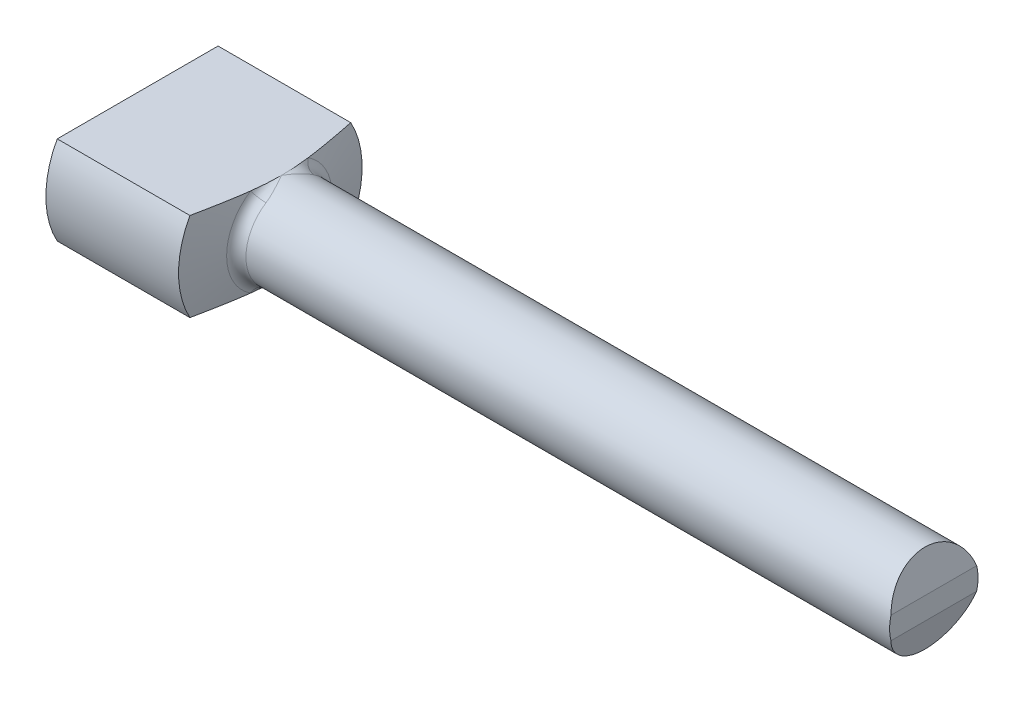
ISO-10303-21;
HEADER;
FILE_DESCRIPTION(('STEP AP214'),'2;1');
FILE_NAME('part.step','',(''),(''),'','','');
FILE_SCHEMA(('AUTOMOTIVE_DESIGN { 1 0 10303 214 1 1 1 1 }'));
ENDSEC;
DATA;
#1=APPLICATION_CONTEXT('core data for automotive mechanical design processes');
#2=APPLICATION_PROTOCOL_DEFINITION('international standard','automotive_design',2000,#1);
#3=PRODUCT_CONTEXT('',#1,'mechanical');
#4=PRODUCT('Part','Part','',(#3));
#5=PRODUCT_RELATED_PRODUCT_CATEGORY('part','',(#4));
#6=PRODUCT_DEFINITION_FORMATION('','',#4);
#7=PRODUCT_DEFINITION_CONTEXT('part definition',#1,'design');
#8=PRODUCT_DEFINITION('design','',#6,#7);
#9=PRODUCT_DEFINITION_SHAPE('','',#8);
#10=(LENGTH_UNIT() NAMED_UNIT(*) SI_UNIT(.MILLI.,.METRE.));
#11=(NAMED_UNIT(*) PLANE_ANGLE_UNIT() SI_UNIT($,.RADIAN.));
#12=(NAMED_UNIT(*) SI_UNIT($,.STERADIAN.) SOLID_ANGLE_UNIT());
#13=UNCERTAINTY_MEASURE_WITH_UNIT(LENGTH_MEASURE(1.E-05),#10,'distance_accuracy_value','');
#14=(GEOMETRIC_REPRESENTATION_CONTEXT(3) GLOBAL_UNCERTAINTY_ASSIGNED_CONTEXT((#13)) GLOBAL_UNIT_ASSIGNED_CONTEXT((#10,
#11,#12)) REPRESENTATION_CONTEXT('',''));
#15=CARTESIAN_POINT('',(0.,0.,0.));
#16=DIRECTION('',(0.,0.,1.));
#17=DIRECTION('',(1.,0.,0.));
#18=AXIS2_PLACEMENT_3D('',#15,#16,#17);
#19=CARTESIAN_POINT('',(0.,0.,0.));
#20=DIRECTION('',(-1.,0.,0.));
#21=DIRECTION('',(0.,-1.,0.));
#22=AXIS2_PLACEMENT_3D('',#19,#20,#21);
#23=PLANE('',#22);
#24=CARTESIAN_POINT('',(0.,0.,0.));
#25=DIRECTION('',(1.,0.,0.));
#26=DIRECTION('',(0.,1.,0.));
#27=AXIS2_PLACEMENT_3D('',#24,#25,#26);
#28=CIRCLE('',#27,4.15);
#29=CARTESIAN_POINT('',(0.,-2.,-3.63627556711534));
#30=VERTEX_POINT('',#29);
#31=CARTESIAN_POINT('',(0.,2.,-3.63627556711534));
#32=VERTEX_POINT('',#31);
#33=EDGE_CURVE('E137',#30,#32,#28,.T.);
#34=ORIENTED_EDGE('',*,*,#33,.F.);
#35=DIRECTION('',(0.,0.,1.));
#36=VECTOR('',#35,1.);
#37=CARTESIAN_POINT('',(0.,-2.,-4.5));
#38=LINE('',#37,#36);
#39=CARTESIAN_POINT('',(0.,-2.,3.63627556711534));
#40=VERTEX_POINT('',#39);
#41=EDGE_CURVE('E269',#30,#40,#38,.T.);
#42=ORIENTED_EDGE('',*,*,#41,.T.);
#43=CARTESIAN_POINT('',(0.,2.,3.63627556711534));
#44=VERTEX_POINT('',#43);
#45=EDGE_CURVE('E138',#44,#40,#28,.T.);
#46=ORIENTED_EDGE('',*,*,#45,.F.);
#47=DIRECTION('',(0.,0.,-1.));
#48=VECTOR('',#47,1.);
#49=CARTESIAN_POINT('',(0.,2.,-4.5));
#50=LINE('',#49,#48);
#51=EDGE_CURVE('E270',#44,#32,#50,.T.);
#52=ORIENTED_EDGE('',*,*,#51,.T.);
#53=EDGE_LOOP('',(#34,#42,#46,#52));
#54=FACE_BOUND('',#53,.T.);
#55=ADVANCED_FACE('F35',(#54),#23,.T.);
#56=CARTESIAN_POINT('',(36.,0.,0.));
#57=DIRECTION('',(1.,0.,0.));
#58=DIRECTION('',(0.,1.,0.));
#59=AXIS2_PLACEMENT_3D('',#56,#57,#58);
#60=CYLINDRICAL_SURFACE('',#59,4.15);
#61=CARTESIAN_POINT('',(6.,0.,0.));
#62=DIRECTION('',(1.,0.,0.));
#63=DIRECTION('',(0.,1.,0.));
#64=AXIS2_PLACEMENT_3D('',#61,#62,#63);
#65=CIRCLE('',#64,4.15);
#66=CARTESIAN_POINT('',(6.,-2.,-3.63627556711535));
#67=VERTEX_POINT('',#66);
#68=CARTESIAN_POINT('',(6.,2.,-3.63627556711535));
#69=VERTEX_POINT('',#68);
#70=EDGE_CURVE('E127',#67,#69,#65,.T.);
#71=ORIENTED_EDGE('',*,*,#70,.F.);
#72=DIRECTION('',(1.,0.,0.));
#73=VECTOR('',#72,1.);
#74=CARTESIAN_POINT('',(36.,-2.00000000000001,-3.63627556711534));
#75=LINE('',#74,#73);
#76=EDGE_CURVE('E276',#67,#30,#75,.F.);
#77=ORIENTED_EDGE('',*,*,#76,.T.);
#78=ORIENTED_EDGE('',*,*,#33,.T.);
#79=DIRECTION('',(1.,0.,0.));
#80=VECTOR('',#79,1.);
#81=CARTESIAN_POINT('',(36.,1.99999999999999,-3.63627556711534));
#82=LINE('',#81,#80);
#83=EDGE_CURVE('E274',#32,#69,#82,.T.);
#84=ORIENTED_EDGE('',*,*,#83,.T.);
#85=EDGE_LOOP('',(#71,#77,#78,#84));
#86=FACE_BOUND('',#85,.T.);
#87=ADVANCED_FACE('F257',(#86),#60,.T.);
#88=ORIENTED_EDGE('',*,*,#45,.T.);
#89=DIRECTION('',(1.,0.,0.));
#90=VECTOR('',#89,1.);
#91=CARTESIAN_POINT('',(36.,-2.00000000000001,3.63627556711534));
#92=LINE('',#91,#90);
#93=CARTESIAN_POINT('',(6.,-2.,3.63627556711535));
#94=VERTEX_POINT('',#93);
#95=EDGE_CURVE('E132',#40,#94,#92,.T.);
#96=ORIENTED_EDGE('',*,*,#95,.T.);
#97=CARTESIAN_POINT('',(6.,2.,3.63627556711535));
#98=VERTEX_POINT('',#97);
#99=EDGE_CURVE('E130',#98,#94,#65,.T.);
#100=ORIENTED_EDGE('',*,*,#99,.F.);
#101=DIRECTION('',(1.,0.,0.));
#102=VECTOR('',#101,1.);
#103=CARTESIAN_POINT('',(36.,1.99999999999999,3.63627556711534));
#104=LINE('',#103,#102);
#105=EDGE_CURVE('E335',#98,#44,#104,.F.);
#106=ORIENTED_EDGE('',*,*,#105,.T.);
#107=EDGE_LOOP('',(#88,#96,#100,#106));
#108=FACE_BOUND('',#107,.T.);
#109=ADVANCED_FACE('F262',(#108),#60,.T.);
#110=CARTESIAN_POINT('',(6.5,0.,0.));
#111=DIRECTION('',(-1.,0.,0.));
#112=DIRECTION('',(0.,-1.,0.));
#113=AXIS2_PLACEMENT_3D('',#110,#111,#112);
#114=CONICAL_SURFACE('',#113,2.,1.34229968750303);
#115=CARTESIAN_POINT('',(5.12737557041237,-2.,-7.64500549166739));
#116=CARTESIAN_POINT('',(5.20334260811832,-2.,-7.30717021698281));
#117=CARTESIAN_POINT('',(5.2790758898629,-2.,-6.96928079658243));
#118=CARTESIAN_POINT('',(5.42958193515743,-2.,-6.29342155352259));
#119=CARTESIAN_POINT('',(5.50435504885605,-2.,-5.95545180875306));
#120=CARTESIAN_POINT('',(5.65261306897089,-2.,-5.27871524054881));
#121=CARTESIAN_POINT('',(5.72609594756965,-2.,-4.9399479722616));
#122=CARTESIAN_POINT('',(5.87075559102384,-2.,-4.26178517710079));
#123=CARTESIAN_POINT('',(5.94193149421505,-2.,-3.92238946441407));
#124=CARTESIAN_POINT('',(6.0455945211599,-2.,-3.41180635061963));
#125=CARTESIAN_POINT('',(6.07971038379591,-2.,-3.24095078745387));
#126=CARTESIAN_POINT('',(6.14635827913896,-2.,-2.89893422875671));
#127=CARTESIAN_POINT('',(6.17889035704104,-2.,-2.72777324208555));
#128=CARTESIAN_POINT('',(6.24165463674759,-2.,-2.38511287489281));
#129=CARTESIAN_POINT('',(6.2718879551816,-2.,-2.21361370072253));
#130=CARTESIAN_POINT('',(6.3289672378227,-2.,-1.87005436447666));
#131=CARTESIAN_POINT('',(6.35581342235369,-2.,-1.69799423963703));
#132=CARTESIAN_POINT('',(6.40452988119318,-2.,-1.35260733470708));
#133=CARTESIAN_POINT('',(6.42638438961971,-2.,-1.17927827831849));
#134=CARTESIAN_POINT('',(6.46265633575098,-2.,-0.831852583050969));
#135=CARTESIAN_POINT('',(6.47707618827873,-2.,-0.657756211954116));
#136=CARTESIAN_POINT('',(6.49137298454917,-2.,-0.396212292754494));
#137=CARTESIAN_POINT('',(6.49491641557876,-2.,-0.308961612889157));
#138=CARTESIAN_POINT('',(6.49938692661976,-2.,-0.134394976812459));
#139=CARTESIAN_POINT('',(6.50031412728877,-2.,-0.0470790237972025));
#140=CARTESIAN_POINT('',(6.49949769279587,-2.,0.127540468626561));
#141=CARTESIAN_POINT('',(6.49775404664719,-2.,0.214844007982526));
#142=CARTESIAN_POINT('',(6.49169378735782,-2.,0.38935243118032));
#143=CARTESIAN_POINT('',(6.48737737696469,-2.,0.476557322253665));
#144=CARTESIAN_POINT('',(6.47214768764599,-2.,0.717917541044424));
#145=CARTESIAN_POINT('',(6.4587140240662,-2.,0.871915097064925));
#146=CARTESIAN_POINT('',(6.42610486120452,-2.,1.17931172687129));
#147=CARTESIAN_POINT('',(6.40692790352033,-2.,1.33271063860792));
#148=CARTESIAN_POINT('',(6.36443911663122,-2.,1.63907385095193));
#149=CARTESIAN_POINT('',(6.3411233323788,-2.,1.79203759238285));
#150=CARTESIAN_POINT('',(6.29160318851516,-2.,2.09747654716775));
#151=CARTESIAN_POINT('',(6.26539907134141,-2.,2.24995180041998));
#152=CARTESIAN_POINT('',(6.21087916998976,-2.,2.5549986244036));
#153=CARTESIAN_POINT('',(6.18255722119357,-2.,2.70756908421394));
#154=CARTESIAN_POINT('',(6.12445253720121,-2.,3.01243251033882));
#155=CARTESIAN_POINT('',(6.09466977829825,-2.,3.16472547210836));
#156=CARTESIAN_POINT('',(6.00378781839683,-2.,3.62112667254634));
#157=CARTESIAN_POINT('',(5.94112439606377,-2.,3.92492238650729));
#158=CARTESIAN_POINT('',(5.81275395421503,-2.,4.53546802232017));
#159=CARTESIAN_POINT('',(5.7470204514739,-2.,4.84221231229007));
#160=CARTESIAN_POINT('',(5.61408854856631,-2.,5.45542427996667));
#161=CARTESIAN_POINT('',(5.54688996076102,-2.,5.76189191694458));
#162=CARTESIAN_POINT('',(5.4116643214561,-2.,6.37412140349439));
#163=CARTESIAN_POINT('',(5.34363879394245,-2.,6.67988359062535));
#164=CARTESIAN_POINT('',(5.20694712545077,-2.,7.29126492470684));
#165=CARTESIAN_POINT('',(5.13828098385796,-2.,7.5968840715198));
#166=CARTESIAN_POINT('',(4.92715843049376,-2.,8.53336489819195));
#167=CARTESIAN_POINT('',(4.78397730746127,-2.,9.16406306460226));
#168=CARTESIAN_POINT('',(4.49652608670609,-2.,10.425563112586));
#169=CARTESIAN_POINT('',(4.35225545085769,-2.,11.0563648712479));
#170=CARTESIAN_POINT('',(4.06534027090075,-2.,12.3080451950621));
#171=CARTESIAN_POINT('',(3.92270520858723,-2.,12.9289259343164));
#172=CARTESIAN_POINT('',(3.63710597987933,-2.,14.1702648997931));
#173=CARTESIAN_POINT('',(3.49414202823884,-2.,14.7907231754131));
#174=CARTESIAN_POINT('',(3.35107184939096,-2.,15.4111567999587));
#175=B_SPLINE_CURVE_WITH_KNOTS('',3,(#115,#116,#117,#118,#119,#120,#121,#122,#123,#124,#125,
#126,#127,#128,#129,#130,#131,#132,#133,#134,#135,#136,#137,#138,#139,#140,#141,#142,#143,#144,
#145,#146,#147,#148,#149,#150,#151,#152,#153,#154,#155,#156,#157,#158,#159,#160,#161,#162,#163,
#164,#165,#166,#167,#168,#169,#170,#171,#172,#173,#174),.UNSPECIFIED.,.F.,.F.,(4,2,2,2,2,2,2,2,
2,2,2,2,2,2,2,2,2,2,2,2,2,2,2,2,2,2,2,2,2,4),(0.,1.03881568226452,2.07724111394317,
3.11717412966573,4.15749119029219,4.68017126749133,5.20283642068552,5.72524604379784,
6.24762166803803,6.77162504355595,7.29545811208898,7.55739149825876,7.81931280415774,
8.08123518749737,8.34313693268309,8.80672568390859,9.27043225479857,9.73458435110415,
10.1986975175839,10.6642185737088,11.1297471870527,12.060300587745,13.001422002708,
13.9426646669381,14.8823775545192,15.8220913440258,17.7623288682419,19.7035971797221,
21.6147586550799,23.5249061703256),.UNSPECIFIED.);
#176=CARTESIAN_POINT('',(6.41005970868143,-2.,1.30251424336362));
#177=VERTEX_POINT('',#176);
#178=EDGE_CURVE('E282',#94,#177,#175,.F.);
#179=ORIENTED_EDGE('',*,*,#178,.T.);
#180=CARTESIAN_POINT('',(6.41005970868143,0.,0.));
#181=DIRECTION('',(-1.,0.,0.));
#182=DIRECTION('',(0.,-1.,0.));
#183=AXIS2_PLACEMENT_3D('',#180,#181,#182);
#184=CIRCLE('',#183,2.38674325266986);
#185=CARTESIAN_POINT('',(6.41005970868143,2.,1.30251424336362));
#186=VERTEX_POINT('',#185);
#187=EDGE_CURVE('E217',#177,#186,#184,.T.);
#188=ORIENTED_EDGE('',*,*,#187,.T.);
#189=CARTESIAN_POINT('',(5.12737557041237,2.,-7.64500549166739));
#190=CARTESIAN_POINT('',(5.20334260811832,2.,-7.30717021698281));
#191=CARTESIAN_POINT('',(5.2790758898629,2.,-6.96928079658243));
#192=CARTESIAN_POINT('',(5.42958193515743,2.,-6.29342155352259));
#193=CARTESIAN_POINT('',(5.50435504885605,2.,-5.95545180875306));
#194=CARTESIAN_POINT('',(5.65261306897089,2.,-5.27871524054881));
#195=CARTESIAN_POINT('',(5.72609594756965,2.,-4.9399479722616));
#196=CARTESIAN_POINT('',(5.87075559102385,2.,-4.26178517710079));
#197=CARTESIAN_POINT('',(5.94193149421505,2.,-3.92238946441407));
#198=CARTESIAN_POINT('',(6.0455945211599,2.,-3.41180635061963));
#199=CARTESIAN_POINT('',(6.07971038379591,2.,-3.24095078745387));
#200=CARTESIAN_POINT('',(6.14635827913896,2.,-2.89893422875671));
#201=CARTESIAN_POINT('',(6.17889035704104,2.,-2.72777324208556));
#202=CARTESIAN_POINT('',(6.24165463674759,2.,-2.38511287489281));
#203=CARTESIAN_POINT('',(6.27188795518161,2.,-2.21361370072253));
#204=CARTESIAN_POINT('',(6.3289672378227,2.,-1.87005436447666));
#205=CARTESIAN_POINT('',(6.35581342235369,2.,-1.69799423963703));
#206=CARTESIAN_POINT('',(6.40452988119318,2.,-1.35260733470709));
#207=CARTESIAN_POINT('',(6.42638438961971,2.,-1.1792782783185));
#208=CARTESIAN_POINT('',(6.46265633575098,2.,-0.831852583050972));
#209=CARTESIAN_POINT('',(6.47707618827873,2.,-0.657756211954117));
#210=CARTESIAN_POINT('',(6.49137298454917,2.,-0.396212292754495));
#211=CARTESIAN_POINT('',(6.49491641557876,2.,-0.308961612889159));
#212=CARTESIAN_POINT('',(6.49938692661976,2.,-0.134394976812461));
#213=CARTESIAN_POINT('',(6.50031412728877,2.,-0.0470790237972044));
#214=CARTESIAN_POINT('',(6.49949769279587,2.,0.127540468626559));
#215=CARTESIAN_POINT('',(6.49775404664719,2.,0.214844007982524));
#216=CARTESIAN_POINT('',(6.49169378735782,2.,0.389352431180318));
#217=CARTESIAN_POINT('',(6.4873773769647,2.,0.476557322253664));
#218=CARTESIAN_POINT('',(6.47214768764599,2.,0.717917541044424));
#219=CARTESIAN_POINT('',(6.4587140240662,2.,0.871915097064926));
#220=CARTESIAN_POINT('',(6.42610486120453,2.,1.17931172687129));
#221=CARTESIAN_POINT('',(6.40692790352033,2.,1.33271063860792));
#222=CARTESIAN_POINT('',(6.36443911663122,2.,1.63907385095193));
#223=CARTESIAN_POINT('',(6.3411233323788,2.,1.79203759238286));
#224=CARTESIAN_POINT('',(6.29160318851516,2.,2.09747654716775));
#225=CARTESIAN_POINT('',(6.26539907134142,2.,2.24995180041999));
#226=CARTESIAN_POINT('',(6.21087916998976,2.,2.55499862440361));
#227=CARTESIAN_POINT('',(6.18255722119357,2.,2.70756908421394));
#228=CARTESIAN_POINT('',(6.12445253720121,2.,3.01243251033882));
#229=CARTESIAN_POINT('',(6.09466977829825,2.,3.16472547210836));
#230=CARTESIAN_POINT('',(6.00378781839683,2.,3.62112667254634));
#231=CARTESIAN_POINT('',(5.94112439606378,2.,3.9249223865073));
#232=CARTESIAN_POINT('',(5.81275395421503,2.,4.53546802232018));
#233=CARTESIAN_POINT('',(5.7470204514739,2.,4.84221231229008));
#234=CARTESIAN_POINT('',(5.61408854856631,2.,5.45542427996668));
#235=CARTESIAN_POINT('',(5.54688996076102,2.,5.76189191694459));
#236=CARTESIAN_POINT('',(5.4116643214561,2.,6.3741214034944));
#237=CARTESIAN_POINT('',(5.34363879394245,2.,6.67988359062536));
#238=CARTESIAN_POINT('',(5.20694712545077,2.,7.29126492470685));
#239=CARTESIAN_POINT('',(5.13828098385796,2.,7.59688407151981));
#240=CARTESIAN_POINT('',(4.92715843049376,2.,8.53336489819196));
#241=CARTESIAN_POINT('',(4.78397730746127,2.,9.16406306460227));
#242=CARTESIAN_POINT('',(4.49652608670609,2.,10.425563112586));
#243=CARTESIAN_POINT('',(4.35225545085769,2.,11.0563648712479));
#244=CARTESIAN_POINT('',(4.06534027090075,2.,12.3080451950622));
#245=CARTESIAN_POINT('',(3.92270520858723,2.,12.9289259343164));
#246=CARTESIAN_POINT('',(3.63710597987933,2.,14.1702648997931));
#247=CARTESIAN_POINT('',(3.49414202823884,2.,14.7907231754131));
#248=CARTESIAN_POINT('',(3.35107184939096,2.,15.4111567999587));
#249=B_SPLINE_CURVE_WITH_KNOTS('',3,(#189,#190,#191,#192,#193,#194,#195,#196,#197,#198,#199,
#200,#201,#202,#203,#204,#205,#206,#207,#208,#209,#210,#211,#212,#213,#214,#215,#216,#217,#218,
#219,#220,#221,#222,#223,#224,#225,#226,#227,#228,#229,#230,#231,#232,#233,#234,#235,#236,#237,
#238,#239,#240,#241,#242,#243,#244,#245,#246,#247,#248),.UNSPECIFIED.,.F.,.F.,(4,2,2,2,2,2,2,2,
2,2,2,2,2,2,2,2,2,2,2,2,2,2,2,2,2,2,2,2,2,4),(0.,1.03881568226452,2.07724111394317,
3.11717412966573,4.15749119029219,4.68017126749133,5.20283642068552,5.72524604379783,
6.24762166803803,6.77162504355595,7.29545811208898,7.55739149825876,7.81931280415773,
8.08123518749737,8.34313693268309,8.80672568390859,9.27043225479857,9.73458435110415,
10.1986975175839,10.6642185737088,11.1297471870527,12.0603005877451,13.001422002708,
13.9426646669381,14.8823775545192,15.8220913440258,17.7623288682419,19.7035971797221,
21.6147586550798,23.5249061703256),.UNSPECIFIED.);
#250=EDGE_CURVE('E329',#186,#98,#249,.T.);
#251=ORIENTED_EDGE('',*,*,#250,.T.);
#252=ORIENTED_EDGE('',*,*,#99,.T.);
#253=EDGE_LOOP('',(#179,#188,#251,#252));
#254=FACE_BOUND('',#253,.T.);
#255=ADVANCED_FACE('F160',(#254),#114,.T.);
#256=CARTESIAN_POINT('',(6.41005970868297,2.,-1.30251424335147));
#257=VERTEX_POINT('',#256);
#258=EDGE_CURVE('E336',#69,#257,#249,.T.);
#259=ORIENTED_EDGE('',*,*,#258,.T.);
#260=CARTESIAN_POINT('',(6.41005970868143,0.,0.));
#261=DIRECTION('',(-1.,0.,0.));
#262=DIRECTION('',(0.,-1.,0.));
#263=AXIS2_PLACEMENT_3D('',#260,#261,#262);
#264=CIRCLE('',#263,2.38674325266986);
#265=CARTESIAN_POINT('',(6.41005970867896,-2.,-1.3025142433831));
#266=VERTEX_POINT('',#265);
#267=EDGE_CURVE('E215',#257,#266,#264,.T.);
#268=ORIENTED_EDGE('',*,*,#267,.T.);
#269=EDGE_CURVE('E284',#266,#67,#175,.F.);
#270=ORIENTED_EDGE('',*,*,#269,.T.);
#271=ORIENTED_EDGE('',*,*,#70,.T.);
#272=EDGE_LOOP('',(#259,#268,#270,#271));
#273=FACE_BOUND('',#272,.T.);
#274=ADVANCED_FACE('F158',(#273),#114,.T.);
#275=CARTESIAN_POINT('',(36.,0.,0.));
#276=DIRECTION('',(1.,0.,0.));
#277=DIRECTION('',(0.,1.,0.));
#278=AXIS2_PLACEMENT_3D('',#275,#276,#277);
#279=CYLINDRICAL_SURFACE('',#278,2.);
#280=CARTESIAN_POINT('',(36.1333333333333,0.,0.));
#281=DIRECTION('',(-0.966234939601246,0.257662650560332,0.));
#282=DIRECTION('',(0.257662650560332,0.966234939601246,0.));
#283=AXIS2_PLACEMENT_3D('',#280,#281,#282);
#284=ELLIPSE('',#283,2.06988995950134,2.);
#285=CARTESIAN_POINT('',(36.,-0.5,1.93649167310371));
#286=VERTEX_POINT('',#285);
#287=CARTESIAN_POINT('',(36.,-0.500000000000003,-1.93649167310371));
#288=VERTEX_POINT('',#287);
#289=EDGE_CURVE('E48',#286,#288,#284,.F.);
#290=ORIENTED_EDGE('',*,*,#289,.F.);
#291=CARTESIAN_POINT('',(36.,0.,0.));
#292=DIRECTION('',(1.,0.,0.));
#293=DIRECTION('',(0.,1.,0.));
#294=AXIS2_PLACEMENT_3D('',#291,#292,#293);
#295=CIRCLE('',#294,2.);
#296=CARTESIAN_POINT('',(36.,0.500000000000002,1.93649167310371));
#297=VERTEX_POINT('',#296);
#298=EDGE_CURVE('E123',#297,#286,#295,.T.);
#299=ORIENTED_EDGE('',*,*,#298,.F.);
#300=CARTESIAN_POINT('',(36.1333333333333,0.,0.));
#301=DIRECTION('',(-0.966234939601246,-0.257662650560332,0.));
#302=DIRECTION('',(0.257662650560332,-0.966234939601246,0.));
#303=AXIS2_PLACEMENT_3D('',#300,#301,#302);
#304=ELLIPSE('',#303,2.06988995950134,2.);
#305=CARTESIAN_POINT('',(36.,0.5,-1.9364916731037));
#306=VERTEX_POINT('',#305);
#307=EDGE_CURVE('E55',#306,#297,#304,.F.);
#308=ORIENTED_EDGE('',*,*,#307,.F.);
#309=EDGE_CURVE('E124',#288,#306,#295,.T.);
#310=ORIENTED_EDGE('',*,*,#309,.F.);
#311=EDGE_LOOP('',(#290,#299,#308,#310));
#312=FACE_BOUND('',#311,.T.);
#313=CARTESIAN_POINT('',(6.50000000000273,-2.,1.15042992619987E-08));
#314=CARTESIAN_POINT('',(6.50000000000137,-2.,5.75214963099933E-09));
#315=CARTESIAN_POINT('',(6.5,-2.,0.));
#316=CARTESIAN_POINT('',(6.50000072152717,-2.,0.00304313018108));
#317=CARTESIAN_POINT('',(6.50068078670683,-2.00000013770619,0.00273865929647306));
#318=CARTESIAN_POINT('',(6.50136078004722,-1.99999998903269,0.00243421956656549));
#319=CARTESIAN_POINT('',(6.49999977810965,-2.,0.00608547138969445));
#320=CARTESIAN_POINT('',(6.50136006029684,-1.99999457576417,0.00547725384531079));
#321=CARTESIAN_POINT('',(6.50272026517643,-1.99999554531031,0.00486902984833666));
#322=CARTESIAN_POINT('',(6.49987879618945,-2.,0.147485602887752));
#323=CARTESIAN_POINT('',(6.53287536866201,-1.99947175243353,0.132824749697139));
#324=CARTESIAN_POINT('',(6.56586017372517,-1.99958253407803,0.118088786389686));
#325=CARTESIAN_POINT('',(6.49632760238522,-2.,0.284223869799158));
#326=CARTESIAN_POINT('',(6.56086544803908,-1.98710911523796,0.258903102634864));
#327=CARTESIAN_POINT('',(6.62489550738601,-1.98999023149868,0.230072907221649));
#328=CARTESIAN_POINT('',(6.4834819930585,-2.,0.553574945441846));
#329=CARTESIAN_POINT('',(6.5994675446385,-1.94063206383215,0.501556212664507));
#330=CARTESIAN_POINT('',(6.73145405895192,-1.95099107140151,0.454519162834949));
#331=CARTESIAN_POINT('',(6.47418067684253,-2.,0.686182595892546));
#332=CARTESIAN_POINT('',(6.6100908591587,-1.90519982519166,0.6212500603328));
#333=CARTESIAN_POINT('',(6.77896334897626,-1.92156040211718,0.566981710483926));
#334=CARTESIAN_POINT('',(6.45643362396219,-2.,0.888207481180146));
#335=CARTESIAN_POINT('',(6.60419272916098,-1.83934094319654,0.790113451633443));
#336=CARTESIAN_POINT('',(6.83721387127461,-1.85952475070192,0.739212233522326));
#337=CARTESIAN_POINT('',(6.44945626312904,-2.,0.959431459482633));
#338=CARTESIAN_POINT('',(6.59719812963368,-1.81275141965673,0.848644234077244));
#339=CARTESIAN_POINT('',(6.85490346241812,-1.83418888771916,0.800112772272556));
#340=CARTESIAN_POINT('',(6.43452141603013,-2.,1.09971179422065));
#341=CARTESIAN_POINT('',(6.57174895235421,-1.75760618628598,0.957198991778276));
#342=CARTESIAN_POINT('',(6.8819376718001,-1.77715693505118,0.919823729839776));
#343=CARTESIAN_POINT('',(6.42656892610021,-2.,1.16877709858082));
#344=CARTESIAN_POINT('',(6.55271609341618,-1.72870948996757,1.00740050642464));
#345=CARTESIAN_POINT('',(6.89132295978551,-1.74549278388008,0.978642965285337));
#346=CARTESIAN_POINT('',(6.41167286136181,-2.,1.2905778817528));
#347=CARTESIAN_POINT('',(6.50655593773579,-1.67980265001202,1.08625582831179));
#348=CARTESIAN_POINT('',(6.89820760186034,-1.68318544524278,1.0815397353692));
#349=CARTESIAN_POINT('',(6.40485320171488,-2.,1.34377686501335));
#350=CARTESIAN_POINT('',(6.48108207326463,-1.65892457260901,1.11739211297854));
#351=CARTESIAN_POINT('',(6.89773671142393,-1.65364523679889,1.12618178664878));
#352=CARTESIAN_POINT('',(6.39443044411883,-2.,1.4220863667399));
#353=CARTESIAN_POINT('',(6.43676328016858,-1.63278964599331,1.15589057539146));
#354=CARTESIAN_POINT('',(6.89026069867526,-1.60683859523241,1.19113063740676));
#355=CARTESIAN_POINT('',(6.39090763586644,-2.,1.44805515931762));
#356=CARTESIAN_POINT('',(6.42048035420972,-1.62479809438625,1.16755773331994));
#357=CARTESIAN_POINT('',(6.88660837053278,-1.59074193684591,1.21253653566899));
#358=CARTESIAN_POINT('',(6.38383238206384,-2.,1.49934297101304));
#359=CARTESIAN_POINT('',(6.38585897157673,-1.61132499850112,1.18782845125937));
#360=CARTESIAN_POINT('',(6.87670456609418,-1.55787843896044,1.25448388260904));
#361=CARTESIAN_POINT('',(6.38027989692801,-2.,1.52466083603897));
#362=CARTESIAN_POINT('',(6.36744013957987,-1.60591588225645,1.19634537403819));
#363=CARTESIAN_POINT('',(6.8704487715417,-1.54111052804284,1.27502383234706));
#364=CARTESIAN_POINT('',(6.37673112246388,-2.,1.54957798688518));
#365=CARTESIAN_POINT('',(6.34846637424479,-1.60233422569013,1.20296441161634));
#366=CARTESIAN_POINT('',(6.86274216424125,-1.52409864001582,1.29503796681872));
#367=(BOUNDED_SURFACE() B_SPLINE_SURFACE(3,2,((#313,#314,#315),(#316,#317,#318),(#319,#320,
#321),(#322,#323,#324),(#325,#326,#327),(#328,#329,#330),(#331,#332,#333),(#334,#335,#336),
(#337,#338,#339),(#340,#341,#342),(#343,#344,#345),(#346,#347,#348),(#349,#350,#351),(#352,#353,
#354),(#355,#356,#357),(#358,#359,#360),(#361,#362,#363),(#364,#365,#366)),.UNSPECIFIED.,.F.,
.F.,.F.) B_SPLINE_SURFACE_WITH_KNOTS((4,2,2,2,2,2,2,2,4),(3,3),(0.,0.0100000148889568,
0.464894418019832,0.920335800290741,1.17266356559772,1.42374862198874,1.62374926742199,
1.72466475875,1.82574830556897),(0.,1.),
.UNSPECIFIED.) GEOMETRIC_REPRESENTATION_ITEM() RATIONAL_B_SPLINE_SURFACE(((1.,1.,1.),(1.,
0.999999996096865,1.),(1.,0.999996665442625,1.),(1.,0.999687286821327,1.),(1.,0.992505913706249,
1.),(1.,0.964855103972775,1.),(1.,0.944369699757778,1.),(1.,0.902565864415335,1.),(1.,
0.885693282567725,1.),(1.,0.848235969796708,1.),(1.,0.827669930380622,1.),(1.,0.787689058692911,
1.),(1.,0.768891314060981,1.),(1.,0.739324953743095,1.),(1.,0.729192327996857,1.),(1.,
0.708553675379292,1.),(1.,0.698047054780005,1.),(1.,0.687401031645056,1.))) REPRESENTATION_ITEM('') SURFACE());
#368=CARTESIAN_POINT('',(6.86274216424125,-1.52409864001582,1.29503796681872));
#369=CARTESIAN_POINT('',(6.8704487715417,-1.54111052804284,1.27502383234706));
#370=CARTESIAN_POINT('',(6.87670456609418,-1.55787843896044,1.25448388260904));
#371=CARTESIAN_POINT('',(6.88660837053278,-1.59074193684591,1.21253653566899));
#372=CARTESIAN_POINT('',(6.89026069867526,-1.60683859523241,1.19113063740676));
#373=CARTESIAN_POINT('',(6.89773671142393,-1.65364523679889,1.12618178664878));
#374=CARTESIAN_POINT('',(6.89820760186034,-1.68318544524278,1.0815397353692));
#375=CARTESIAN_POINT('',(6.89132295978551,-1.74549278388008,0.978642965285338));
#376=CARTESIAN_POINT('',(6.8819376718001,-1.77715693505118,0.919823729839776));
#377=CARTESIAN_POINT('',(6.85490346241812,-1.83418888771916,0.800112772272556));
#378=CARTESIAN_POINT('',(6.83721387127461,-1.85952475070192,0.739212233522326));
#379=CARTESIAN_POINT('',(6.77896334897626,-1.92156040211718,0.566981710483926));
#380=CARTESIAN_POINT('',(6.73145405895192,-1.95099107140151,0.45451916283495));
#381=CARTESIAN_POINT('',(6.62489550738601,-1.98999023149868,0.230072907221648));
#382=CARTESIAN_POINT('',(6.56586017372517,-1.99958253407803,0.118088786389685));
#383=CARTESIAN_POINT('',(6.50272026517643,-1.99999554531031,0.00486902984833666));
#384=CARTESIAN_POINT('',(6.50136078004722,-1.99999998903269,0.00243421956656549));
#385=CARTESIAN_POINT('',(6.5,-2.,0.));
#386=B_SPLINE_CURVE_WITH_KNOTS('',3,(#368,#369,#370,#371,#372,#373,#374,#375,#376,#377,#378,
#379,#380,#381,#382,#383,#384,#385),.UNSPECIFIED.,.F.,.F.,(4,2,2,2,2,2,2,2,4),(0.,
0.101083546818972,0.201999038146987,0.40199968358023,0.653084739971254,0.905412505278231,
1.36085388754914,1.81574829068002,1.82574830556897),.UNSPECIFIED.);
#387=CARTESIAN_POINT('',(6.89706372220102,-1.67592387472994,1.09145735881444));
#388=VERTEX_POINT('',#387);
#389=CARTESIAN_POINT('',(6.5,-2.,0.));
#390=VERTEX_POINT('',#389);
#391=EDGE_CURVE('E141',#388,#390,#386,.T.);
#392=ORIENTED_EDGE('',*,*,#391,.T.);
#393=CARTESIAN_POINT('',(6.36942423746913,-2.,-1.60036790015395));
#394=CARTESIAN_POINT('',(6.30776919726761,-1.59757637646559,-1.21421361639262));
#395=CARTESIAN_POINT('',(6.84470146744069,-1.48873836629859,-1.33553662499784));
#396=CARTESIAN_POINT('',(6.37604066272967,-2.,-1.55483239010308));
#397=CARTESIAN_POINT('',(6.3448456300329,-1.59911398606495,-1.20691951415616));
#398=CARTESIAN_POINT('',(6.86297956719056,-1.52113555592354,-1.29950830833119));
#399=CARTESIAN_POINT('',(6.38270453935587,-2.,-1.50777814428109));
#400=CARTESIAN_POINT('',(6.38041730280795,-1.60815009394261,-1.19244616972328));
#401=CARTESIAN_POINT('',(6.8758477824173,-1.55281402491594,-1.26147754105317));
#402=CARTESIAN_POINT('',(6.39586784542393,-2.,-1.41175442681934));
#403=CARTESIAN_POINT('',(6.44332078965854,-1.63500539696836,-1.15241687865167));
#404=CARTESIAN_POINT('',(6.89258022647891,-1.61355594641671,-1.18272018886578));
#405=CARTESIAN_POINT('',(6.40236822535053,-2.,-1.36280666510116));
#406=CARTESIAN_POINT('',(6.47120736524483,-1.65234290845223,-1.12746155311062));
#407=CARTESIAN_POINT('',(6.89652654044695,-1.64264085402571,-1.14202175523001));
#408=CARTESIAN_POINT('',(6.4178996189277,-2.,-1.24111867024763));
#409=CARTESIAN_POINT('',(6.52785240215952,-1.69857454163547,-1.05690773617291));
#410=CARTESIAN_POINT('',(6.89771451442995,-1.70987887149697,-1.03997731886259));
#411=CARTESIAN_POINT('',(6.42677069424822,-2.,-1.16747657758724));
#412=CARTESIAN_POINT('',(6.5535077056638,-1.72967347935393,-1.00663105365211));
#413=CARTESIAN_POINT('',(6.89119480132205,-1.74631382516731,-0.977496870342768));
#414=CARTESIAN_POINT('',(6.44349318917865,-2.,-1.01750741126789));
#415=CARTESIAN_POINT('',(6.58893384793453,-1.79021231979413,-0.895169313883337));
#416=CARTESIAN_POINT('',(6.86768715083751,-1.81194311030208,-0.849743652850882));
#417=CARTESIAN_POINT('',(6.45133838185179,-2.,-0.941167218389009));
#418=CARTESIAN_POINT('',(6.59956646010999,-1.82003452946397,-0.833877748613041));
#419=CARTESIAN_POINT('',(6.85063858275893,-1.84109412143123,-0.784456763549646));
#420=CARTESIAN_POINT('',(6.46859692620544,-2.,-0.754010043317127));
#421=CARTESIAN_POINT('',(6.61058332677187,-1.88445037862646,-0.679003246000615));
#422=CARTESIAN_POINT('',(6.80010917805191,-1.90257765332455,-0.624729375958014));
#423=CARTESIAN_POINT('',(6.47727629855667,-2.,-0.642230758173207));
#424=CARTESIAN_POINT('',(6.60601431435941,-1.91761530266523,-0.579994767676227));
#425=CARTESIAN_POINT('',(6.76273055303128,-1.93106721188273,-0.529605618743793));
#426=CARTESIAN_POINT('',(6.49074077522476,-2.,-0.415668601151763));
#427=CARTESIAN_POINT('',(6.58183573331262,-1.96705931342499,-0.377635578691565));
#428=CARTESIAN_POINT('',(6.67825299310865,-1.97343809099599,-0.339208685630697));
#429=CARTESIAN_POINT('',(6.49553138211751,-2.,-0.300890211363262));
#430=CARTESIAN_POINT('',(6.56246534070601,-1.98433710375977,-0.272491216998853));
#431=CARTESIAN_POINT('',(6.63116791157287,-1.98734006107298,-0.243935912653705));
#432=CARTESIAN_POINT('',(6.49927419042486,-2.,-0.126542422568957));
#433=CARTESIAN_POINT('',(6.52772396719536,-1.99746979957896,-0.11428300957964));
#434=CARTESIAN_POINT('',(6.55613961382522,-1.9979758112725,-0.101762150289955));
#435=CARTESIAN_POINT('',(6.49994676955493,-2.,-0.0679969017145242));
#436=CARTESIAN_POINT('',(6.51515708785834,-1.99976829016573,-0.0612255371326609));
#437=CARTESIAN_POINT('',(6.53036566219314,-1.99981453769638,-0.0544413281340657));
#438=CARTESIAN_POINT('',(6.49999977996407,-2.,-0.00608554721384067));
#439=CARTESIAN_POINT('',(6.50136004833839,-1.99999444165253,-0.00547735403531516));
#440=CARTESIAN_POINT('',(6.50272030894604,-1.99999555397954,-0.00486912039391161));
#441=CARTESIAN_POINT('',(6.50000072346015,-2.,-0.00304320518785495));
#442=CARTESIAN_POINT('',(6.50068077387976,-1.99999999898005,-0.00273876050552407));
#443=CARTESIAN_POINT('',(6.50136082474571,-1.99999999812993,-0.0024343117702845));
#444=CARTESIAN_POINT('',(6.5,-2.,0.));
#445=CARTESIAN_POINT('',(6.5,-2.,0.));
#446=CARTESIAN_POINT('',(6.5,-2.,0.));
#447=(BOUNDED_SURFACE() B_SPLINE_SURFACE(3,2,((#393,#394,#395),(#396,#397,#398),(#399,#400,
#401),(#402,#403,#404),(#405,#406,#407),(#408,#409,#410),(#411,#412,#413),(#414,#415,#416),
(#417,#418,#419),(#420,#421,#422),(#423,#424,#425),(#426,#427,#428),(#429,#430,#431),(#432,#433,
#434),(#435,#436,#437),(#438,#439,#440),(#441,#442,#443),(#444,#445,#446)),.UNSPECIFIED.,.F.,
.F.,.F.) B_SPLINE_SURFACE_WITH_KNOTS((4,2,2,2,2,2,2,2,4),(3,3),(0.,0.188984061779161,
0.376222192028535,0.646714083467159,0.918778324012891,1.30558037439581,1.69183414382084,
1.88539135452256,1.89539136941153),(0.,1.),
.UNSPECIFIED.) GEOMETRIC_REPRESENTATION_ITEM() RATIONAL_B_SPLINE_SURFACE(((1.,0.665271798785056,
1.),(1.,0.685516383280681,1.),(1.,0.705350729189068,1.),(1.,0.743546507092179,1.),(1.,
0.761919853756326,1.),(1.,0.804716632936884,1.),(1.,0.828197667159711,1.),(1.,0.870990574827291,
1.),(1.,0.890277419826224,1.),(1.,0.931465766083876,1.),(1.,0.951039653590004,1.),(1.,
0.980651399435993,1.),(1.,0.990702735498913,1.),(1.,0.998485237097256,1.),(1.,0.99986111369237,
1.),(1.,0.999996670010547,1.),(1.,1.00000000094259,1.),(1.,1.,1.))) REPRESENTATION_ITEM('') SURFACE());
#448=CARTESIAN_POINT('',(6.84470146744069,-1.48873836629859,-1.33553662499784));
#449=CARTESIAN_POINT('',(6.86297956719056,-1.52113555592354,-1.29950830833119));
#450=CARTESIAN_POINT('',(6.8758477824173,-1.55281402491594,-1.26147754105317));
#451=CARTESIAN_POINT('',(6.89258022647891,-1.61355594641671,-1.18272018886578));
#452=CARTESIAN_POINT('',(6.89652654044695,-1.64264085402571,-1.14202175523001));
#453=CARTESIAN_POINT('',(6.89771451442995,-1.70987887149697,-1.03997731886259));
#454=CARTESIAN_POINT('',(6.89119480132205,-1.74631382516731,-0.977496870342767));
#455=CARTESIAN_POINT('',(6.86768715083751,-1.81194311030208,-0.849743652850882));
#456=CARTESIAN_POINT('',(6.85063858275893,-1.84109412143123,-0.784456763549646));
#457=CARTESIAN_POINT('',(6.80010917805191,-1.90257765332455,-0.624729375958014));
#458=CARTESIAN_POINT('',(6.76273055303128,-1.93106721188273,-0.529605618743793));
#459=CARTESIAN_POINT('',(6.67825299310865,-1.97343809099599,-0.339208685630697));
#460=CARTESIAN_POINT('',(6.63116791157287,-1.98734006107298,-0.243935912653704));
#461=CARTESIAN_POINT('',(6.55613961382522,-1.9979758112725,-0.101762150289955));
#462=CARTESIAN_POINT('',(6.53036566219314,-1.99981453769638,-0.054441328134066));
#463=CARTESIAN_POINT('',(6.50272030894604,-1.99999555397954,-0.00486912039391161));
#464=CARTESIAN_POINT('',(6.50136082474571,-1.99999999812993,-0.0024343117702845));
#465=CARTESIAN_POINT('',(6.5,-2.,0.));
#466=B_SPLINE_CURVE_WITH_KNOTS('',3,(#448,#449,#450,#451,#452,#453,#454,#455,#456,#457,#458,
#459,#460,#461,#462,#463,#464,#465),.UNSPECIFIED.,.F.,.F.,(4,2,2,2,2,2,2,2,4),(0.,
0.188984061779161,0.376222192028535,0.646714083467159,0.918778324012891,1.30558037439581,
1.69183414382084,1.88539135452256,1.89539136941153),.UNSPECIFIED.);
#467=CARTESIAN_POINT('',(6.89706372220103,-1.67592387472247,-1.0914573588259));
#468=VERTEX_POINT('',#467);
#469=EDGE_CURVE('E209',#390,#468,#466,.F.);
#470=ORIENTED_EDGE('',*,*,#469,.T.);
#471=CARTESIAN_POINT('',(6.89706372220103,0.,0.));
#472=DIRECTION('',(1.,0.,0.));
#473=DIRECTION('',(0.,1.,0.));
#474=AXIS2_PLACEMENT_3D('',#471,#472,#473);
#475=CIRCLE('',#474,2.);
#476=CARTESIAN_POINT('',(6.89706372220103,1.67592387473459,-1.09145735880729));
#477=VERTEX_POINT('',#476);
#478=EDGE_CURVE('E205',#468,#477,#475,.T.);
#479=ORIENTED_EDGE('',*,*,#478,.T.);
#480=CARTESIAN_POINT('',(6.5,2.,0.));
#481=CARTESIAN_POINT('',(6.5,2.,0.));
#482=CARTESIAN_POINT('',(6.5,2.,0.));
#483=CARTESIAN_POINT('',(6.50000072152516,2.,-0.00304312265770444));
#484=CARTESIAN_POINT('',(6.50068078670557,2.00000013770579,-0.00273865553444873));
#485=CARTESIAN_POINT('',(6.50136078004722,1.99999998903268,-0.00243421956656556));
#486=CARTESIAN_POINT('',(6.49999977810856,2.,-0.00608546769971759));
#487=CARTESIAN_POINT('',(6.50136006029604,1.99999457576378,-0.00547725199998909));
#488=CARTESIAN_POINT('',(6.50272026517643,1.99999554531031,-0.00486902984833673));
#489=CARTESIAN_POINT('',(6.49987879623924,2.,-0.147485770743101));
#490=CARTESIAN_POINT('',(6.53287536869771,1.99947175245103,-0.132824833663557));
#491=CARTESIAN_POINT('',(6.56586017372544,1.99958253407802,-0.11808878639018));
#492=CARTESIAN_POINT('',(6.49632760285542,2.,-0.284223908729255));
#493=CARTESIAN_POINT('',(6.56086544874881,1.98710911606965,-0.258903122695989));
#494=CARTESIAN_POINT('',(6.62489550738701,1.98999023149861,-0.230072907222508));
#495=CARTESIAN_POINT('',(6.48348199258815,2.,-0.553574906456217));
#496=CARTESIAN_POINT('',(6.59946754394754,1.94063206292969,-0.501556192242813));
#497=CARTESIAN_POINT('',(6.73145405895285,1.95099107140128,-0.454519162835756));
#498=CARTESIAN_POINT('',(6.47418067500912,2.,-0.686182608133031));
#499=CARTESIAN_POINT('',(6.6100908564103,1.9051998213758,-0.621250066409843));
#500=CARTESIAN_POINT('',(6.77896334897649,1.92156040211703,-0.566981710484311));
#501=CARTESIAN_POINT('',(6.45643362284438,2.,-0.888207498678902));
#502=CARTESIAN_POINT('',(6.60419272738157,1.83934094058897,-0.790113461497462));
#503=CARTESIAN_POINT('',(6.83721387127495,1.85952475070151,-0.739212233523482));
#504=CARTESIAN_POINT('',(6.44945626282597,2.,-0.959431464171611));
#505=CARTESIAN_POINT('',(6.59719812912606,1.81275141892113,-0.84864423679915));
#506=CARTESIAN_POINT('',(6.8549034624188,1.83418888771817,-0.800112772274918));
#507=CARTESIAN_POINT('',(6.43452141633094,2.,-1.09971178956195));
#508=CARTESIAN_POINT('',(6.57174895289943,1.75760618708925,-0.957198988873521));
#509=CARTESIAN_POINT('',(6.88193767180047,1.77715693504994,-0.919823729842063));
#510=CARTESIAN_POINT('',(6.42656892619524,2.,-1.16877709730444));
#511=CARTESIAN_POINT('',(6.55271609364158,1.72870949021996,-1.00740050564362));
#512=CARTESIAN_POINT('',(6.89132295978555,1.74549278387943,-0.978642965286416));
#513=CARTESIAN_POINT('',(6.41167286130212,2.,-1.29057788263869));
#514=CARTESIAN_POINT('',(6.50655593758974,1.67980264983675,-1.08625582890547));
#515=CARTESIAN_POINT('',(6.89820760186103,1.68318544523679,-1.08153973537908));
#516=CARTESIAN_POINT('',(6.40485320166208,2.,-1.34377686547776));
#517=CARTESIAN_POINT('',(6.4810820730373,1.65892457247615,-1.11739211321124));
#518=CARTESIAN_POINT('',(6.8977367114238,1.65364523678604,-1.12618178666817));
#519=CARTESIAN_POINT('',(6.39443044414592,2.,-1.42208636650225));
#520=CARTESIAN_POINT('',(6.43676328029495,1.63278964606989,-1.15589057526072));
#521=CARTESIAN_POINT('',(6.89026069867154,1.60683859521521,-1.19113063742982));
#522=CARTESIAN_POINT('',(6.39090763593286,2.,-1.44805515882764));
#523=CARTESIAN_POINT('',(6.42048035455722,1.62479809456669,-1.1675577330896));
#524=CARTESIAN_POINT('',(6.88660837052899,1.59074193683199,-1.21253653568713));
#525=CARTESIAN_POINT('',(6.38383238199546,2.,-1.49934297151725));
#526=CARTESIAN_POINT('',(6.38585897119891,1.61132499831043,-1.18782845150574));
#527=CARTESIAN_POINT('',(6.87670456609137,1.5578784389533,-1.25448388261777));
#528=CARTESIAN_POINT('',(6.38027989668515,2.,-1.5246608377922));
#529=CARTESIAN_POINT('',(6.36744013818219,1.6059158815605,-1.19634537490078));
#530=CARTESIAN_POINT('',(6.87044877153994,1.54111052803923,-1.27502383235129));
#531=CARTESIAN_POINT('',(6.37673112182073,2.,-1.54957799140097));
#532=CARTESIAN_POINT('',(6.34846637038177,1.60233422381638,-1.20296441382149));
#533=CARTESIAN_POINT('',(6.86274216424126,1.52409864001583,-1.29503796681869));
#534=(BOUNDED_SURFACE() B_SPLINE_SURFACE(3,2,((#480,#481,#482),(#483,#484,#485),(#486,#487,
#488),(#489,#490,#491),(#492,#493,#494),(#495,#496,#497),(#498,#499,#500),(#501,#502,#503),
(#504,#505,#506),(#507,#508,#509),(#510,#511,#512),(#513,#514,#515),(#516,#517,#518),(#519,#520,
#521),(#522,#523,#524),(#525,#526,#527),(#528,#529,#530),(#531,#532,#533)),.UNSPECIFIED.,.F.,
.F.,.F.) B_SPLINE_SURFACE_WITH_KNOTS((4,2,2,2,2,2,2,2,4),(3,3),(0.,0.0100000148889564,
0.464894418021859,0.920335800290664,1.17266356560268,1.42374862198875,1.62374926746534,
1.72466475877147,1.82574830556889),(0.,1.),
.UNSPECIFIED.) GEOMETRIC_REPRESENTATION_ITEM() RATIONAL_B_SPLINE_SURFACE(((1.,1.,1.),(1.,
0.999999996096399,1.),(1.,0.999996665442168,1.),(1.,0.999687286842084,1.),(1.,0.992505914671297,
1.),(1.,0.9648551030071,1.),(1.,0.944369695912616,1.),(1.,0.902565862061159,1.),(1.,
0.885693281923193,1.),(1.,0.848235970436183,1.),(1.,0.827669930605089,1.),(1.,0.787689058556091,
1.),(1.,0.768891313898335,1.),(1.,0.739324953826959,1.),(1.,0.729192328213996,1.),(1.,
0.708553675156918,1.),(1.,0.698047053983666,1.),(1.,0.687401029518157,1.))) REPRESENTATION_ITEM('') SURFACE());
#535=CARTESIAN_POINT('',(6.86274216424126,1.52409864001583,-1.29503796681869));
#536=CARTESIAN_POINT('',(6.87044877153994,1.54111052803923,-1.27502383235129));
#537=CARTESIAN_POINT('',(6.87670456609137,1.5578784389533,-1.25448388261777));
#538=CARTESIAN_POINT('',(6.88660837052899,1.59074193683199,-1.21253653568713));
#539=CARTESIAN_POINT('',(6.89026069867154,1.60683859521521,-1.19113063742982));
#540=CARTESIAN_POINT('',(6.8977367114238,1.65364523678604,-1.12618178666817));
#541=CARTESIAN_POINT('',(6.89820760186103,1.68318544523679,-1.08153973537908));
#542=CARTESIAN_POINT('',(6.89132295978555,1.74549278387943,-0.978642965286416));
#543=CARTESIAN_POINT('',(6.88193767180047,1.77715693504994,-0.919823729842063));
#544=CARTESIAN_POINT('',(6.8549034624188,1.83418888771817,-0.800112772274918));
#545=CARTESIAN_POINT('',(6.83721387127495,1.85952475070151,-0.739212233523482));
#546=CARTESIAN_POINT('',(6.7789633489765,1.92156040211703,-0.566981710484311));
#547=CARTESIAN_POINT('',(6.73145405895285,1.95099107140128,-0.454519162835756));
#548=CARTESIAN_POINT('',(6.62489550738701,1.98999023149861,-0.230072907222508));
#549=CARTESIAN_POINT('',(6.56586017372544,1.99958253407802,-0.11808878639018));
#550=CARTESIAN_POINT('',(6.50272026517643,1.99999554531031,-0.00486902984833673));
#551=CARTESIAN_POINT('',(6.50136078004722,1.99999998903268,-0.00243421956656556));
#552=CARTESIAN_POINT('',(6.5,2.,0.));
#553=B_SPLINE_CURVE_WITH_KNOTS('',3,(#535,#536,#537,#538,#539,#540,#541,#542,#543,#544,#545,
#546,#547,#548,#549,#550,#551,#552),.UNSPECIFIED.,.F.,.F.,(4,2,2,2,2,2,2,2,4),(0.,
0.101083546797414,0.201999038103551,0.401999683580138,0.653084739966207,0.905412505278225,
1.36085388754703,1.81574829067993,1.82574830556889),.UNSPECIFIED.);
#554=CARTESIAN_POINT('',(6.5,2.,0.));
#555=VERTEX_POINT('',#554);
#556=EDGE_CURVE('E199',#477,#555,#553,.T.);
#557=ORIENTED_EDGE('',*,*,#556,.T.);
#558=CARTESIAN_POINT('',(6.36942423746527,2.,1.60036790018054));
#559=CARTESIAN_POINT('',(6.30776919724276,1.59757637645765,1.2142136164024));
#560=CARTESIAN_POINT('',(6.84470146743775,1.48873836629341,1.33553662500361));
#561=CARTESIAN_POINT('',(6.37604066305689,2.,1.55483238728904));
#562=CARTESIAN_POINT('',(6.34484563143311,1.59911398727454,1.20691951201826));
#563=CARTESIAN_POINT('',(6.86297956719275,1.52113555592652,1.29950830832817));
#564=CARTESIAN_POINT('',(6.38270453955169,2.,1.50777814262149));
#565=CARTESIAN_POINT('',(6.38041730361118,1.60815009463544,1.19244616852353));
#566=CARTESIAN_POINT('',(6.87584778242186,1.55281402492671,1.2614775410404));
#567=CARTESIAN_POINT('',(6.39586784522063,2.,1.41175442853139));
#568=CARTESIAN_POINT('',(6.44332078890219,1.63500539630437,1.15241687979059));
#569=CARTESIAN_POINT('',(6.89258022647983,1.61355594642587,1.18272018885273));
#570=CARTESIAN_POINT('',(6.40236822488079,2.,1.36280666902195));
#571=CARTESIAN_POINT('',(6.47120736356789,1.65234290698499,1.12746155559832));
#572=CARTESIAN_POINT('',(6.89652654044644,1.64264085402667,1.14202175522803));
#573=CARTESIAN_POINT('',(6.41789961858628,2.,1.24111867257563));
#574=CARTESIAN_POINT('',(6.52785240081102,1.6985745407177,1.05690773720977));
#575=CARTESIAN_POINT('',(6.89771451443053,1.70987887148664,1.039977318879));
#576=CARTESIAN_POINT('',(6.42677069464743,2.,1.16747657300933));
#577=CARTESIAN_POINT('',(6.55350770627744,1.7296734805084,1.00663105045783));
#578=CARTESIAN_POINT('',(6.89119480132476,1.74631382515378,0.977496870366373));
#579=CARTESIAN_POINT('',(6.44349318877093,2.,1.01750741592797));
#580=CARTESIAN_POINT('',(6.58893384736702,1.7902123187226,0.895169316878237));
#581=CARTESIAN_POINT('',(6.86768715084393,1.81194311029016,0.849743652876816));
#582=CARTESIAN_POINT('',(6.45133837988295,2.,0.94116723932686));
#583=CARTESIAN_POINT('',(6.59956645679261,1.82003452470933,0.833877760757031));
#584=CARTESIAN_POINT('',(6.85063858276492,1.84109412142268,0.784456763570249));
#585=CARTESIAN_POINT('',(6.4685969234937,2.,0.754010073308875));
#586=CARTESIAN_POINT('',(6.61058332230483,1.88445037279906,0.679003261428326));
#587=CARTESIAN_POINT('',(6.80010917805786,1.9025776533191,0.624729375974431));
#588=CARTESIAN_POINT('',(6.47727629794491,2.,0.642230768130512));
#589=CARTESIAN_POINT('',(6.60601431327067,1.91761530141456,0.579994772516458));
#590=CARTESIAN_POINT('',(6.76273055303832,1.93106721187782,0.529605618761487));
#591=CARTESIAN_POINT('',(6.49074077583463,2.,0.415668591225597));
#592=CARTESIAN_POINT('',(6.58183573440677,1.96705931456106,0.377635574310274));
#593=CARTESIAN_POINT('',(6.67825299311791,1.97343809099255,0.339208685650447));
#594=CARTESIAN_POINT('',(6.49553138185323,2.,0.300890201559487));
#595=CARTESIAN_POINT('',(6.56246534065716,1.98433710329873,0.272491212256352));
#596=CARTESIAN_POINT('',(6.63116791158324,1.98734006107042,0.243935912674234));
#597=CARTESIAN_POINT('',(6.49927419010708,2.,0.126542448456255));
#598=CARTESIAN_POINT('',(6.52772396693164,1.99746979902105,0.11428302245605));
#599=CARTESIAN_POINT('',(6.55613961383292,1.99797581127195,0.101762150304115));
#600=CARTESIAN_POINT('',(6.49994676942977,2.,0.0679969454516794));
#601=CARTESIAN_POINT('',(6.51515708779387,1.99976828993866,0.0612255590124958));
#602=CARTESIAN_POINT('',(6.53036566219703,1.99981453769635,0.0544413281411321));
#603=CARTESIAN_POINT('',(6.49999977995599,2.,0.00608556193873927));
#604=CARTESIAN_POINT('',(6.50136004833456,1.99999444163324,0.00547736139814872));
#605=CARTESIAN_POINT('',(6.50272030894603,1.99999555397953,0.00486912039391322));
#606=CARTESIAN_POINT('',(6.50000072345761,2.,0.00304321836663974));
#607=CARTESIAN_POINT('',(6.50068077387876,1.99999999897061,0.00273876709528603));
#608=CARTESIAN_POINT('',(6.50136082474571,1.99999999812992,0.00243431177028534));
#609=CARTESIAN_POINT('',(6.50000000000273,2.,1.15042992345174E-08));
#610=CARTESIAN_POINT('',(6.50000000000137,2.,5.75214961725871E-09));
#611=CARTESIAN_POINT('',(6.5,2.,0.));
#612=(BOUNDED_SURFACE() B_SPLINE_SURFACE(3,2,((#558,#559,#560),(#561,#562,#563),(#564,#565,
#566),(#567,#568,#569),(#570,#571,#572),(#573,#574,#575),(#576,#577,#578),(#579,#580,#581),
(#582,#583,#584),(#585,#586,#587),(#588,#589,#590),(#591,#592,#593),(#594,#595,#596),(#597,#598,
#599),(#600,#601,#602),(#603,#604,#605),(#606,#607,#608),(#609,#610,#611)),.UNSPECIFIED.,.F.,
.F.,.F.) B_SPLINE_SURFACE_WITH_KNOTS((4,2,2,2,2,2,2,2,4),(3,3),(0.,0.188984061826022,
0.376222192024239,0.646714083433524,0.918778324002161,1.30558037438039,1.69183414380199,
1.88539135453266,1.89539136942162),(0.,1.),
.UNSPECIFIED.) GEOMETRIC_REPRESENTATION_ITEM() RATIONAL_B_SPLINE_SURFACE(((1.,0.665271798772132,
1.),(1.,0.685516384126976,1.),(1.,0.705350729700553,1.),(1.,0.743546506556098,1.),(1.,
0.761919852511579,1.),(1.,0.804716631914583,1.),(1.,0.828197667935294,1.),(1.,0.870990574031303,
1.),(1.,0.890277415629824,1.),(1.,0.931465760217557,1.),(1.,0.951039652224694,1.),(1.,
0.980651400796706,1.),(1.,0.990702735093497,1.),(1.,0.998485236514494,1.),(1.,0.999861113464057,
1.),(1.,0.999996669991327,1.),(1.,1.00000000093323,1.),(1.,1.,1.))) REPRESENTATION_ITEM('') SURFACE());
#613=CARTESIAN_POINT('',(6.84470146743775,1.48873836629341,1.33553662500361));
#614=CARTESIAN_POINT('',(6.86297956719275,1.52113555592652,1.29950830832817));
#615=CARTESIAN_POINT('',(6.87584778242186,1.55281402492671,1.2614775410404));
#616=CARTESIAN_POINT('',(6.89258022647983,1.61355594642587,1.18272018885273));
#617=CARTESIAN_POINT('',(6.89652654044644,1.64264085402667,1.14202175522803));
#618=CARTESIAN_POINT('',(6.89771451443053,1.70987887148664,1.039977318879));
#619=CARTESIAN_POINT('',(6.89119480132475,1.74631382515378,0.977496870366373));
#620=CARTESIAN_POINT('',(6.86768715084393,1.81194311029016,0.849743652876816));
#621=CARTESIAN_POINT('',(6.85063858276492,1.84109412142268,0.784456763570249));
#622=CARTESIAN_POINT('',(6.80010917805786,1.9025776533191,0.624729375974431));
#623=CARTESIAN_POINT('',(6.76273055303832,1.93106721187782,0.529605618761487));
#624=CARTESIAN_POINT('',(6.67825299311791,1.97343809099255,0.339208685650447));
#625=CARTESIAN_POINT('',(6.63116791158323,1.98734006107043,0.243935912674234));
#626=CARTESIAN_POINT('',(6.55613961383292,1.99797581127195,0.101762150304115));
#627=CARTESIAN_POINT('',(6.53036566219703,1.99981453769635,0.0544413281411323));
#628=CARTESIAN_POINT('',(6.50272030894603,1.99999555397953,0.00486912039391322));
#629=CARTESIAN_POINT('',(6.50136082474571,1.99999999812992,0.00243431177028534));
#630=CARTESIAN_POINT('',(6.5,2.,0.));
#631=B_SPLINE_CURVE_WITH_KNOTS('',3,(#613,#614,#615,#616,#617,#618,#619,#620,#621,#622,#623,
#624,#625,#626,#627,#628,#629,#630),.UNSPECIFIED.,.F.,.F.,(4,2,2,2,2,2,2,2,4),(0.,
0.188984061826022,0.376222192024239,0.646714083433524,0.918778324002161,1.30558037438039,
1.69183414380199,1.88539135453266,1.89539136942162),.UNSPECIFIED.);
#632=CARTESIAN_POINT('',(6.89706372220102,1.67592387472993,1.09145735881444));
#633=VERTEX_POINT('',#632);
#634=EDGE_CURVE('E194',#555,#633,#631,.F.);
#635=ORIENTED_EDGE('',*,*,#634,.T.);
#636=CARTESIAN_POINT('',(6.89706372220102,0.,0.));
#637=DIRECTION('',(1.,0.,0.));
#638=DIRECTION('',(0.,1.,0.));
#639=AXIS2_PLACEMENT_3D('',#636,#637,#638);
#640=CIRCLE('',#639,2.);
#641=EDGE_CURVE('E148',#633,#388,#640,.T.);
#642=ORIENTED_EDGE('',*,*,#641,.T.);
#643=EDGE_LOOP('',(#392,#470,#479,#557,#635,#642));
#644=FACE_BOUND('',#643,.T.);
#645=ADVANCED_FACE('F121',(#312,#644),#279,.T.);
#646=CARTESIAN_POINT('',(36.,1.99999999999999,0.));
#647=DIRECTION('',(1.,0.,0.));
#648=DIRECTION('',(0.,1.,0.));
#649=AXIS2_PLACEMENT_3D('',#646,#647,#648);
#650=PLANE('',#649);
#651=DIRECTION('',(0.,0.,1.));
#652=VECTOR('',#651,1.);
#653=CARTESIAN_POINT('',(36.,-0.500000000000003,0.));
#654=LINE('',#653,#652);
#655=EDGE_CURVE('E12',#288,#286,#654,.T.);
#656=ORIENTED_EDGE('',*,*,#655,.F.);
#657=ORIENTED_EDGE('',*,*,#309,.T.);
#658=DIRECTION('',(0.,0.,-1.));
#659=VECTOR('',#658,1.);
#660=CARTESIAN_POINT('',(36.,0.500000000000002,0.));
#661=LINE('',#660,#659);
#662=EDGE_CURVE('E43',#297,#306,#661,.T.);
#663=ORIENTED_EDGE('',*,*,#662,.F.);
#664=ORIENTED_EDGE('',*,*,#298,.T.);
#665=EDGE_LOOP('',(#656,#657,#663,#664));
#666=FACE_BOUND('',#665,.T.);
#667=ADVANCED_FACE('F126',(#666),#650,.T.);
#668=CARTESIAN_POINT('',(10.,2.,-4.5));
#669=DIRECTION('',(0.,1.,0.));
#670=DIRECTION('',(-1.,0.,0.));
#671=AXIS2_PLACEMENT_3D('',#668,#669,#670);
#672=PLANE('',#671);
#673=ORIENTED_EDGE('',*,*,#51,.F.);
#674=ORIENTED_EDGE('',*,*,#105,.F.);
#675=ORIENTED_EDGE('',*,*,#250,.F.);
#676=EDGE_CURVE('E330',#555,#186,#249,.T.);
#677=ORIENTED_EDGE('',*,*,#676,.F.);
#678=EDGE_CURVE('E338',#257,#555,#249,.T.);
#679=ORIENTED_EDGE('',*,*,#678,.F.);
#680=ORIENTED_EDGE('',*,*,#258,.F.);
#681=ORIENTED_EDGE('',*,*,#83,.F.);
#682=EDGE_LOOP('',(#673,#674,#675,#677,#679,#680,#681));
#683=FACE_BOUND('',#682,.T.);
#684=ADVANCED_FACE('F295',(#683),#672,.T.);
#685=CARTESIAN_POINT('',(10.,-2.,-4.5));
#686=DIRECTION('',(0.,-1.,0.));
#687=DIRECTION('',(1.,0.,0.));
#688=AXIS2_PLACEMENT_3D('',#685,#686,#687);
#689=PLANE('',#688);
#690=ORIENTED_EDGE('',*,*,#41,.F.);
#691=ORIENTED_EDGE('',*,*,#76,.F.);
#692=ORIENTED_EDGE('',*,*,#269,.F.);
#693=EDGE_CURVE('E280',#390,#266,#175,.F.);
#694=ORIENTED_EDGE('',*,*,#693,.F.);
#695=EDGE_CURVE('E279',#177,#390,#175,.F.);
#696=ORIENTED_EDGE('',*,*,#695,.F.);
#697=ORIENTED_EDGE('',*,*,#178,.F.);
#698=ORIENTED_EDGE('',*,*,#95,.F.);
#699=EDGE_LOOP('',(#690,#691,#692,#694,#696,#697,#698));
#700=FACE_BOUND('',#699,.T.);
#701=ADVANCED_FACE('F253',(#700),#689,.T.);
#702=ORIENTED_EDGE('',*,*,#678,.T.);
#703=ORIENTED_EDGE('',*,*,#556,.F.);
#704=CARTESIAN_POINT('',(6.89706372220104,2.09490484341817,-1.36432169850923));
#705=DIRECTION('',(-6.17539370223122E-12,0.545728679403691,0.837961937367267));
#706=DIRECTION('',(0.,-0.837961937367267,0.545728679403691));
#707=AXIS2_PLACEMENT_3D('',#704,#705,#706);
#708=CIRCLE('',#707,0.5);
#709=EDGE_CURVE('E221',#257,#477,#708,.T.);
#710=ORIENTED_EDGE('',*,*,#709,.F.);
#711=EDGE_LOOP('',(#702,#703,#710));
#712=FACE_BOUND('',#711,.T.);
#713=ADVANCED_FACE('F175',(#712),#534,.F.);
#714=CARTESIAN_POINT('',(6.89706372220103,0.,0.));
#715=DIRECTION('',(1.,0.,0.));
#716=DIRECTION('',(0.,1.,0.));
#717=AXIS2_PLACEMENT_3D('',#714,#715,#716);
#718=TOROIDAL_SURFACE('',#717,2.5,0.5);
#719=ORIENTED_EDGE('',*,*,#709,.T.);
#720=ORIENTED_EDGE('',*,*,#478,.F.);
#721=CARTESIAN_POINT('',(6.89706372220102,-2.09490484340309,-1.36432169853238));
#722=DIRECTION('',(0.,0.545728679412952,-0.837961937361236));
#723=DIRECTION('',(0.,0.837961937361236,0.545728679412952));
#724=AXIS2_PLACEMENT_3D('',#721,#722,#723);
#725=CIRCLE('',#724,0.5);
#726=EDGE_CURVE('E219',#266,#468,#725,.T.);
#727=ORIENTED_EDGE('',*,*,#726,.F.);
#728=ORIENTED_EDGE('',*,*,#267,.F.);
#729=EDGE_LOOP('',(#719,#720,#727,#728));
#730=FACE_BOUND('',#729,.T.);
#731=ADVANCED_FACE('F245',(#730),#718,.F.);
#732=ORIENTED_EDGE('',*,*,#469,.F.);
#733=ORIENTED_EDGE('',*,*,#693,.T.);
#734=ORIENTED_EDGE('',*,*,#726,.T.);
#735=EDGE_LOOP('',(#732,#733,#734));
#736=FACE_BOUND('',#735,.T.);
#737=ADVANCED_FACE('F166',(#736),#447,.F.);
#738=ORIENTED_EDGE('',*,*,#695,.T.);
#739=ORIENTED_EDGE('',*,*,#391,.F.);
#740=CARTESIAN_POINT('',(6.89706372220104,-2.09490484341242,1.36432169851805));
#741=DIRECTION('',(0.,-0.545728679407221,-0.837961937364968));
#742=DIRECTION('',(0.,0.837961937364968,-0.545728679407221));
#743=AXIS2_PLACEMENT_3D('',#740,#741,#742);
#744=CIRCLE('',#743,0.5);
#745=EDGE_CURVE('E222',#177,#388,#744,.T.);
#746=ORIENTED_EDGE('',*,*,#745,.F.);
#747=EDGE_LOOP('',(#738,#739,#746));
#748=FACE_BOUND('',#747,.T.);
#749=ADVANCED_FACE('F188',(#748),#367,.F.);
#750=CARTESIAN_POINT('',(6.89706372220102,0.,0.));
#751=DIRECTION('',(1.,0.,0.));
#752=DIRECTION('',(0.,1.,0.));
#753=AXIS2_PLACEMENT_3D('',#750,#751,#752);
#754=TOROIDAL_SURFACE('',#753,2.5,0.5);
#755=ORIENTED_EDGE('',*,*,#745,.T.);
#756=ORIENTED_EDGE('',*,*,#641,.F.);
#757=CARTESIAN_POINT('',(6.89706372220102,2.09490484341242,1.36432169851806));
#758=DIRECTION('',(0.,-0.545728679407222,0.837961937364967));
#759=DIRECTION('',(0.,-0.837961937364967,-0.545728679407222));
#760=AXIS2_PLACEMENT_3D('',#757,#758,#759);
#761=CIRCLE('',#760,0.5);
#762=EDGE_CURVE('E323',#186,#633,#761,.T.);
#763=ORIENTED_EDGE('',*,*,#762,.F.);
#764=ORIENTED_EDGE('',*,*,#187,.F.);
#765=EDGE_LOOP('',(#755,#756,#763,#764));
#766=FACE_BOUND('',#765,.T.);
#767=ADVANCED_FACE('F367',(#766),#754,.F.);
#768=ORIENTED_EDGE('',*,*,#634,.F.);
#769=ORIENTED_EDGE('',*,*,#676,.T.);
#770=ORIENTED_EDGE('',*,*,#762,.T.);
#771=EDGE_LOOP('',(#768,#769,#770));
#772=FACE_BOUND('',#771,.T.);
#773=ADVANCED_FACE('F182',(#772),#612,.F.);
#774=CARTESIAN_POINT('',(35.6,1.99999999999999,-4.15));
#775=DIRECTION('',(-0.966234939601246,-0.257662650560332,0.));
#776=DIRECTION('',(0.257662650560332,-0.966234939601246,0.));
#777=AXIS2_PLACEMENT_3D('',#774,#775,#776);
#778=PLANE('',#777);
#779=ORIENTED_EDGE('',*,*,#307,.T.);
#780=ORIENTED_EDGE('',*,*,#662,.T.);
#781=EDGE_LOOP('',(#779,#780));
#782=FACE_BOUND('',#781,.T.);
#783=ADVANCED_FACE('F296',(#782),#778,.F.);
#784=CARTESIAN_POINT('',(35.6,-1.99999999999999,-4.15));
#785=DIRECTION('',(-0.966234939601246,0.257662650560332,0.));
#786=DIRECTION('',(-0.257662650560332,-0.966234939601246,0.));
#787=AXIS2_PLACEMENT_3D('',#784,#785,#786);
#788=PLANE('',#787);
#789=ORIENTED_EDGE('',*,*,#289,.T.);
#790=ORIENTED_EDGE('',*,*,#655,.T.);
#791=EDGE_LOOP('',(#789,#790));
#792=FACE_BOUND('',#791,.T.);
#793=ADVANCED_FACE('F115',(#792),#788,.F.);
#794=CLOSED_SHELL('',(#55,#87,#109,#255,#274,#645,#667,#684,#701,#713,#731,#737,#749,#767,#773,
#783,#793));
#795=MANIFOLD_SOLID_BREP('B2',#794);
#796=ADVANCED_BREP_SHAPE_REPRESENTATION('',(#18,#795),#14);
#797=SHAPE_DEFINITION_REPRESENTATION(#9,#796);
ENDSEC;
END-ISO-10303-21;
